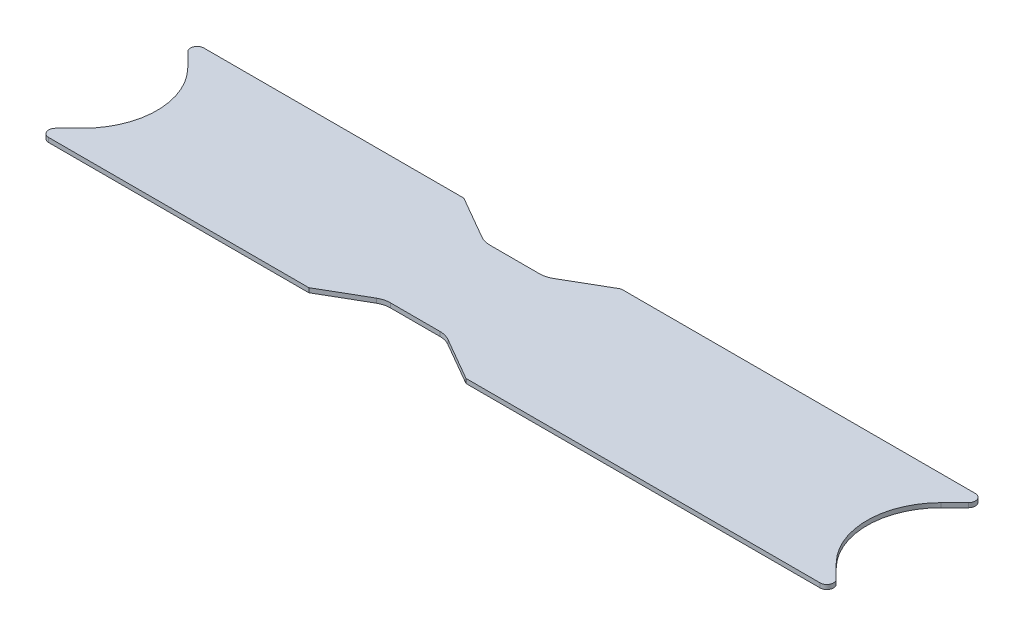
ISO-10303-21;
HEADER;
FILE_DESCRIPTION(('STEP AP214'),'2;1');
FILE_NAME('part.step','',(''),(''),'','','');
FILE_SCHEMA(('AUTOMOTIVE_DESIGN { 1 0 10303 214 1 1 1 1 }'));
ENDSEC;
DATA;
#1=APPLICATION_CONTEXT('core data for automotive mechanical design processes');
#2=APPLICATION_PROTOCOL_DEFINITION('international standard','automotive_design',2000,#1);
#3=PRODUCT_CONTEXT('',#1,'mechanical');
#4=PRODUCT('Part','Part','',(#3));
#5=PRODUCT_RELATED_PRODUCT_CATEGORY('part','',(#4));
#6=PRODUCT_DEFINITION_FORMATION('','',#4);
#7=PRODUCT_DEFINITION_CONTEXT('part definition',#1,'design');
#8=PRODUCT_DEFINITION('design','',#6,#7);
#9=PRODUCT_DEFINITION_SHAPE('','',#8);
#10=(LENGTH_UNIT() NAMED_UNIT(*) SI_UNIT(.MILLI.,.METRE.));
#11=(NAMED_UNIT(*) PLANE_ANGLE_UNIT() SI_UNIT($,.RADIAN.));
#12=(NAMED_UNIT(*) SI_UNIT($,.STERADIAN.) SOLID_ANGLE_UNIT());
#13=UNCERTAINTY_MEASURE_WITH_UNIT(LENGTH_MEASURE(1.E-05),#10,'distance_accuracy_value','');
#14=(GEOMETRIC_REPRESENTATION_CONTEXT(3) GLOBAL_UNCERTAINTY_ASSIGNED_CONTEXT((#13)) GLOBAL_UNIT_ASSIGNED_CONTEXT((#10,
#11,#12)) REPRESENTATION_CONTEXT('',''));
#15=CARTESIAN_POINT('',(0.,0.,0.));
#16=DIRECTION('',(0.,0.,1.));
#17=DIRECTION('',(1.,0.,0.));
#18=AXIS2_PLACEMENT_3D('',#15,#16,#17);
#19=CARTESIAN_POINT('',(-19.375,0.2,0.));
#20=DIRECTION('',(0.,1.,0.));
#21=DIRECTION('',(0.,0.,1.));
#22=AXIS2_PLACEMENT_3D('',#19,#20,#21);
#23=PLANE('',#22);
#24=CARTESIAN_POINT('',(-1.00897459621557,0.199999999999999,3.25));
#25=DIRECTION('',(0.,1.,0.));
#26=DIRECTION('',(0.,0.,1.));
#27=AXIS2_PLACEMENT_3D('',#24,#25,#26);
#28=CIRCLE('',#27,1.);
#29=CARTESIAN_POINT('',(-1.00897459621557,0.199999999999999,2.25));
#30=VERTEX_POINT('',#29);
#31=CARTESIAN_POINT('',(-0.508974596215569,0.199999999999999,2.38397459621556));
#32=VERTEX_POINT('',#31);
#33=EDGE_CURVE('E217',#30,#32,#28,.F.);
#34=ORIENTED_EDGE('',*,*,#33,.T.);
#35=DIRECTION('',(0.866025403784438,0.,0.500000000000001));
#36=VECTOR('',#35,1.);
#37=CARTESIAN_POINT('',(-0.508974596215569,0.199999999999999,2.38397459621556));
#38=LINE('',#37,#36);
#39=CARTESIAN_POINT('',(1.42403810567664,0.199999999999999,3.5));
#40=VERTEX_POINT('',#39);
#41=EDGE_CURVE('E220',#40,#32,#38,.F.);
#42=ORIENTED_EDGE('',*,*,#41,.F.);
#43=DIRECTION('',(1.,0.,0.));
#44=VECTOR('',#43,1.);
#45=CARTESIAN_POINT('',(1.42403810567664,0.199999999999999,3.5));
#46=LINE('',#45,#44);
#47=CARTESIAN_POINT('',(17.4131204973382,0.199999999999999,3.5));
#48=VERTEX_POINT('',#47);
#49=EDGE_CURVE('E113',#48,#40,#46,.F.);
#50=ORIENTED_EDGE('',*,*,#49,.F.);
#51=CARTESIAN_POINT('',(17.4131204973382,0.199999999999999,3.2));
#52=DIRECTION('',(0.,1.,0.));
#53=DIRECTION('',(0.,0.,1.));
#54=AXIS2_PLACEMENT_3D('',#51,#52,#53);
#55=CIRCLE('',#54,0.3);
#56=CARTESIAN_POINT('',(17.6252525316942,0.199999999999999,2.98786796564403));
#57=VERTEX_POINT('',#56);
#58=EDGE_CURVE('E20',#48,#57,#55,.T.);
#59=ORIENTED_EDGE('',*,*,#58,.T.);
#60=DIRECTION('',(-0.707106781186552,0.,-0.707106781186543));
#61=VECTOR('',#60,1.);
#62=CARTESIAN_POINT('',(17.6252525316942,0.199999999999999,2.98786796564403));
#63=LINE('',#62,#61);
#64=CARTESIAN_POINT('',(17.0061922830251,0.199999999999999,2.36880771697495));
#65=VERTEX_POINT('',#64);
#66=EDGE_CURVE('E253',#65,#57,#63,.F.);
#67=ORIENTED_EDGE('',*,*,#66,.F.);
#68=CARTESIAN_POINT('',(19.375,0.199999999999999,0.));
#69=DIRECTION('',(0.,1.,0.));
#70=DIRECTION('',(0.,0.,1.));
#71=AXIS2_PLACEMENT_3D('',#68,#69,#70);
#72=CIRCLE('',#71,3.35);
#73=CARTESIAN_POINT('',(17.0061922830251,0.199999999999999,-2.36880771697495));
#74=VERTEX_POINT('',#73);
#75=EDGE_CURVE('E251',#65,#74,#72,.F.);
#76=ORIENTED_EDGE('',*,*,#75,.T.);
#77=DIRECTION('',(0.707106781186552,0.,-0.707106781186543));
#78=VECTOR('',#77,1.);
#79=CARTESIAN_POINT('',(17.0061922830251,0.199999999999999,-2.36880771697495));
#80=LINE('',#79,#78);
#81=CARTESIAN_POINT('',(17.6252525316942,0.199999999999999,-2.98786796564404));
#82=VERTEX_POINT('',#81);
#83=EDGE_CURVE('E194',#82,#74,#80,.F.);
#84=ORIENTED_EDGE('',*,*,#83,.F.);
#85=CARTESIAN_POINT('',(17.4131204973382,0.199999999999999,-3.2));
#86=DIRECTION('',(0.,1.,0.));
#87=DIRECTION('',(0.,0.,1.));
#88=AXIS2_PLACEMENT_3D('',#85,#86,#87);
#89=CIRCLE('',#88,0.299999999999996);
#90=CARTESIAN_POINT('',(17.4131204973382,0.199999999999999,-3.5));
#91=VERTEX_POINT('',#90);
#92=EDGE_CURVE('E196',#91,#82,#89,.F.);
#93=ORIENTED_EDGE('',*,*,#92,.F.);
#94=DIRECTION('',(-1.,0.,0.));
#95=VECTOR('',#94,1.);
#96=CARTESIAN_POINT('',(17.4131204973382,0.199999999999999,-3.5));
#97=LINE('',#96,#95);
#98=CARTESIAN_POINT('',(1.42403810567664,0.200000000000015,-3.5));
#99=VERTEX_POINT('',#98);
#100=EDGE_CURVE('E299',#99,#91,#97,.F.);
#101=ORIENTED_EDGE('',*,*,#100,.F.);
#102=DIRECTION('',(-0.866025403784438,0.,0.500000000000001));
#103=VECTOR('',#102,1.);
#104=CARTESIAN_POINT('',(1.42403810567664,0.200000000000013,-3.5));
#105=LINE('',#104,#103);
#106=CARTESIAN_POINT('',(-0.508974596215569,0.200000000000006,-2.38397459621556));
#107=VERTEX_POINT('',#106);
#108=EDGE_CURVE('E293',#107,#99,#105,.F.);
#109=ORIENTED_EDGE('',*,*,#108,.F.);
#110=CARTESIAN_POINT('',(-1.00897459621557,0.199999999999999,-3.25));
#111=DIRECTION('',(0.,1.,0.));
#112=DIRECTION('',(0.,0.,1.));
#113=AXIS2_PLACEMENT_3D('',#110,#111,#112);
#114=CIRCLE('',#113,1.);
#115=CARTESIAN_POINT('',(-1.00897459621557,0.199999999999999,-2.25));
#116=VERTEX_POINT('',#115);
#117=EDGE_CURVE('E245',#107,#116,#114,.F.);
#118=ORIENTED_EDGE('',*,*,#117,.T.);
#119=DIRECTION('',(-1.,0.,0.));
#120=VECTOR('',#119,1.);
#121=CARTESIAN_POINT('',(-1.00897459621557,0.199999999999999,-2.25));
#122=LINE('',#121,#120);
#123=CARTESIAN_POINT('',(-3.24102540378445,0.199999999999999,-2.25));
#124=VERTEX_POINT('',#123);
#125=EDGE_CURVE('E248',#124,#116,#122,.F.);
#126=ORIENTED_EDGE('',*,*,#125,.F.);
#127=CARTESIAN_POINT('',(-3.24102540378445,0.199999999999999,-3.25));
#128=DIRECTION('',(0.,1.,0.));
#129=DIRECTION('',(0.,0.,1.));
#130=AXIS2_PLACEMENT_3D('',#127,#128,#129);
#131=CIRCLE('',#130,1.);
#132=CARTESIAN_POINT('',(-3.74102540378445,0.199999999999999,-2.38397459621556));
#133=VERTEX_POINT('',#132);
#134=EDGE_CURVE('E240',#124,#133,#131,.F.);
#135=ORIENTED_EDGE('',*,*,#134,.T.);
#136=DIRECTION('',(-0.866025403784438,0.,-0.500000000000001));
#137=VECTOR('',#136,1.);
#138=CARTESIAN_POINT('',(-3.74102540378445,0.199999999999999,-2.38397459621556));
#139=LINE('',#138,#137);
#140=CARTESIAN_POINT('',(-5.67403810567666,0.199999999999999,-3.5));
#141=VERTEX_POINT('',#140);
#142=EDGE_CURVE('E243',#141,#133,#139,.F.);
#143=ORIENTED_EDGE('',*,*,#142,.F.);
#144=DIRECTION('',(-1.,0.,0.));
#145=VECTOR('',#144,1.);
#146=CARTESIAN_POINT('',(-5.67403810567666,0.199999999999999,-3.5));
#147=LINE('',#146,#145);
#148=CARTESIAN_POINT('',(-17.4131204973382,0.199999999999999,-3.5));
#149=VERTEX_POINT('',#148);
#150=EDGE_CURVE('E283',#149,#141,#147,.F.);
#151=ORIENTED_EDGE('',*,*,#150,.F.);
#152=CARTESIAN_POINT('',(-17.4131204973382,0.199999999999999,-3.2));
#153=DIRECTION('',(0.,1.,0.));
#154=DIRECTION('',(0.,0.,1.));
#155=AXIS2_PLACEMENT_3D('',#152,#153,#154);
#156=CIRCLE('',#155,0.3);
#157=CARTESIAN_POINT('',(-17.6252525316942,0.199999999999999,-2.98786796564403));
#158=VERTEX_POINT('',#157);
#159=EDGE_CURVE('E236',#158,#149,#156,.F.);
#160=ORIENTED_EDGE('',*,*,#159,.F.);
#161=DIRECTION('',(0.707106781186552,0.,0.707106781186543));
#162=VECTOR('',#161,1.);
#163=CARTESIAN_POINT('',(-17.6252525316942,0.199999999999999,-2.98786796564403));
#164=LINE('',#163,#162);
#165=CARTESIAN_POINT('',(-17.0061922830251,0.199999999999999,-2.36880771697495));
#166=VERTEX_POINT('',#165);
#167=EDGE_CURVE('E280',#166,#158,#164,.F.);
#168=ORIENTED_EDGE('',*,*,#167,.F.);
#169=CARTESIAN_POINT('',(-19.375,0.199999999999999,0.));
#170=DIRECTION('',(0.,1.,0.));
#171=DIRECTION('',(0.,0.,1.));
#172=AXIS2_PLACEMENT_3D('',#169,#170,#171);
#173=CIRCLE('',#172,3.35);
#174=CARTESIAN_POINT('',(-17.0061922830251,0.199999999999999,2.36880771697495));
#175=VERTEX_POINT('',#174);
#176=EDGE_CURVE('E231',#166,#175,#173,.F.);
#177=ORIENTED_EDGE('',*,*,#176,.T.);
#178=DIRECTION('',(-0.707106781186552,0.,0.707106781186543));
#179=VECTOR('',#178,1.);
#180=CARTESIAN_POINT('',(-17.0061922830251,0.199999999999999,2.36880771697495));
#181=LINE('',#180,#179);
#182=CARTESIAN_POINT('',(-17.6252525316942,0.199999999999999,2.98786796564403));
#183=VERTEX_POINT('',#182);
#184=EDGE_CURVE('E234',#183,#175,#181,.F.);
#185=ORIENTED_EDGE('',*,*,#184,.F.);
#186=CARTESIAN_POINT('',(-17.4131204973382,0.199999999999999,3.2));
#187=DIRECTION('',(0.,1.,0.));
#188=DIRECTION('',(0.,0.,1.));
#189=AXIS2_PLACEMENT_3D('',#186,#187,#188);
#190=CIRCLE('',#189,0.3);
#191=CARTESIAN_POINT('',(-17.4131204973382,0.199999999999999,3.5));
#192=VERTEX_POINT('',#191);
#193=EDGE_CURVE('E227',#192,#183,#190,.F.);
#194=ORIENTED_EDGE('',*,*,#193,.F.);
#195=DIRECTION('',(1.,0.,0.));
#196=VECTOR('',#195,1.);
#197=CARTESIAN_POINT('',(-17.4131204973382,0.199999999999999,3.5));
#198=LINE('',#197,#196);
#199=CARTESIAN_POINT('',(-5.67403810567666,0.199999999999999,3.5));
#200=VERTEX_POINT('',#199);
#201=EDGE_CURVE('E275',#200,#192,#198,.F.);
#202=ORIENTED_EDGE('',*,*,#201,.F.);
#203=DIRECTION('',(0.866025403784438,0.,-0.500000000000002));
#204=VECTOR('',#203,1.);
#205=CARTESIAN_POINT('',(-5.67403810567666,0.199999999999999,3.5));
#206=LINE('',#205,#204);
#207=CARTESIAN_POINT('',(-3.74102540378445,0.199999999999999,2.38397459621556));
#208=VERTEX_POINT('',#207);
#209=EDGE_CURVE('E269',#208,#200,#206,.F.);
#210=ORIENTED_EDGE('',*,*,#209,.F.);
#211=CARTESIAN_POINT('',(-3.24102540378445,0.199999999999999,3.25));
#212=DIRECTION('',(0.,1.,0.));
#213=DIRECTION('',(0.,0.,1.));
#214=AXIS2_PLACEMENT_3D('',#211,#212,#213);
#215=CIRCLE('',#214,1.);
#216=CARTESIAN_POINT('',(-3.24102540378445,0.199999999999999,2.25));
#217=VERTEX_POINT('',#216);
#218=EDGE_CURVE('E222',#208,#217,#215,.F.);
#219=ORIENTED_EDGE('',*,*,#218,.T.);
#220=DIRECTION('',(1.,0.,0.));
#221=VECTOR('',#220,1.);
#222=CARTESIAN_POINT('',(-3.24102540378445,0.199999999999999,2.25));
#223=LINE('',#222,#221);
#224=EDGE_CURVE('E225',#30,#217,#223,.F.);
#225=ORIENTED_EDGE('',*,*,#224,.F.);
#226=EDGE_LOOP('',(#34,#42,#50,#59,#67,#76,#84,#93,#101,#109,#118,#126,#135,#143,#151,#160,#168,
#177,#185,#194,#202,#210,#219,#225));
#227=FACE_BOUND('',#226,.T.);
#228=ADVANCED_FACE('F17',(#227),#23,.T.);
#229=CARTESIAN_POINT('',(17.6252525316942,-37.2943833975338,2.98786796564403));
#230=DIRECTION('',(0.707106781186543,0.,-0.707106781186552));
#231=DIRECTION('',(-0.707106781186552,0.,-0.707106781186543));
#232=AXIS2_PLACEMENT_3D('',#229,#230,#231);
#233=PLANE('',#232);
#234=DIRECTION('',(0.,1.,0.));
#235=VECTOR('',#234,1.);
#236=CARTESIAN_POINT('',(17.6252525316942,-37.2943833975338,2.98786796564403));
#237=LINE('',#236,#235);
#238=CARTESIAN_POINT('',(17.6252525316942,0.,2.98786796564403));
#239=VERTEX_POINT('',#238);
#240=EDGE_CURVE('E216',#239,#57,#237,.T.);
#241=ORIENTED_EDGE('',*,*,#240,.F.);
#242=DIRECTION('',(-0.707106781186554,0.,-0.707106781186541));
#243=VECTOR('',#242,1.);
#244=CARTESIAN_POINT('',(17.6252525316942,0.,2.98786796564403));
#245=LINE('',#244,#243);
#246=CARTESIAN_POINT('',(17.0061922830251,0.,2.36880771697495));
#247=VERTEX_POINT('',#246);
#248=EDGE_CURVE('E209',#239,#247,#245,.T.);
#249=ORIENTED_EDGE('',*,*,#248,.T.);
#250=DIRECTION('',(0.,1.,0.));
#251=VECTOR('',#250,1.);
#252=CARTESIAN_POINT('',(17.0061922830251,-37.2943833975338,2.36880771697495));
#253=LINE('',#252,#251);
#254=EDGE_CURVE('E182',#247,#65,#253,.T.);
#255=ORIENTED_EDGE('',*,*,#254,.T.);
#256=ORIENTED_EDGE('',*,*,#66,.T.);
#257=EDGE_LOOP('',(#241,#249,#255,#256));
#258=FACE_BOUND('',#257,.T.);
#259=ADVANCED_FACE('F390',(#258),#233,.T.);
#260=CARTESIAN_POINT('',(19.375,-37.2943833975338,0.));
#261=DIRECTION('',(0.,1.,0.));
#262=DIRECTION('',(0.,0.,1.));
#263=AXIS2_PLACEMENT_3D('',#260,#261,#262);
#264=CYLINDRICAL_SURFACE('',#263,3.35);
#265=ORIENTED_EDGE('',*,*,#75,.F.);
#266=ORIENTED_EDGE('',*,*,#254,.F.);
#267=CARTESIAN_POINT('',(19.375,0.,0.));
#268=DIRECTION('',(0.,1.,0.));
#269=DIRECTION('',(0.,0.,1.));
#270=AXIS2_PLACEMENT_3D('',#267,#268,#269);
#271=CIRCLE('',#270,3.35);
#272=CARTESIAN_POINT('',(17.0061922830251,0.,-2.36880771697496));
#273=VERTEX_POINT('',#272);
#274=EDGE_CURVE('E202',#247,#273,#271,.F.);
#275=ORIENTED_EDGE('',*,*,#274,.T.);
#276=DIRECTION('',(0.,1.,0.));
#277=VECTOR('',#276,1.);
#278=CARTESIAN_POINT('',(17.0061922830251,-37.2943833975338,-2.36880771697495));
#279=LINE('',#278,#277);
#280=EDGE_CURVE('E188',#74,#273,#279,.F.);
#281=ORIENTED_EDGE('',*,*,#280,.F.);
#282=EDGE_LOOP('',(#265,#266,#275,#281));
#283=FACE_BOUND('',#282,.T.);
#284=ADVANCED_FACE('F208',(#283),#264,.F.);
#285=CARTESIAN_POINT('',(17.0061922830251,-37.2943833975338,-2.36880771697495));
#286=DIRECTION('',(0.707106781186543,0.,0.707106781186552));
#287=DIRECTION('',(0.707106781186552,0.,-0.707106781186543));
#288=AXIS2_PLACEMENT_3D('',#285,#286,#287);
#289=PLANE('',#288);
#290=ORIENTED_EDGE('',*,*,#280,.T.);
#291=DIRECTION('',(0.707106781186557,0.,-0.707106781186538));
#292=VECTOR('',#291,1.);
#293=CARTESIAN_POINT('',(17.0061922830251,0.,-2.36880771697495));
#294=LINE('',#293,#292);
#295=CARTESIAN_POINT('',(17.6252525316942,0.,-2.98786796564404));
#296=VERTEX_POINT('',#295);
#297=EDGE_CURVE('E192',#273,#296,#294,.T.);
#298=ORIENTED_EDGE('',*,*,#297,.T.);
#299=DIRECTION('',(0.,1.,0.));
#300=VECTOR('',#299,1.);
#301=CARTESIAN_POINT('',(17.6252525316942,-37.2943833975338,-2.98786796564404));
#302=LINE('',#301,#300);
#303=EDGE_CURVE('E250',#82,#296,#302,.F.);
#304=ORIENTED_EDGE('',*,*,#303,.F.);
#305=ORIENTED_EDGE('',*,*,#83,.T.);
#306=EDGE_LOOP('',(#290,#298,#304,#305));
#307=FACE_BOUND('',#306,.T.);
#308=ADVANCED_FACE('F190',(#307),#289,.T.);
#309=CARTESIAN_POINT('',(17.4131204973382,-37.2943833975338,-3.2));
#310=DIRECTION('',(0.,1.,0.));
#311=DIRECTION('',(0.,0.,1.));
#312=AXIS2_PLACEMENT_3D('',#309,#310,#311);
#313=CYLINDRICAL_SURFACE('',#312,0.299999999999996);
#314=ORIENTED_EDGE('',*,*,#303,.T.);
#315=CARTESIAN_POINT('',(17.4131204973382,0.,-3.2));
#316=DIRECTION('',(0.,1.,0.));
#317=DIRECTION('',(0.,0.,1.));
#318=AXIS2_PLACEMENT_3D('',#315,#316,#317);
#319=CIRCLE('',#318,0.299999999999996);
#320=CARTESIAN_POINT('',(17.4131204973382,0.,-3.5));
#321=VERTEX_POINT('',#320);
#322=EDGE_CURVE('E206',#296,#321,#319,.T.);
#323=ORIENTED_EDGE('',*,*,#322,.T.);
#324=DIRECTION('',(0.,1.,0.));
#325=VECTOR('',#324,1.);
#326=CARTESIAN_POINT('',(17.4131204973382,-37.2943833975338,-3.5));
#327=LINE('',#326,#325);
#328=EDGE_CURVE('E296',#91,#321,#327,.F.);
#329=ORIENTED_EDGE('',*,*,#328,.F.);
#330=ORIENTED_EDGE('',*,*,#92,.T.);
#331=EDGE_LOOP('',(#314,#323,#329,#330));
#332=FACE_BOUND('',#331,.T.);
#333=ADVANCED_FACE('F383',(#332),#313,.T.);
#334=CARTESIAN_POINT('',(17.4131204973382,-37.2943833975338,-3.5));
#335=DIRECTION('',(0.,0.,-1.));
#336=DIRECTION('',(-1.,0.,0.));
#337=AXIS2_PLACEMENT_3D('',#334,#335,#336);
#338=PLANE('',#337);
#339=ORIENTED_EDGE('',*,*,#328,.T.);
#340=DIRECTION('',(1.,0.,0.));
#341=VECTOR('',#340,1.);
#342=CARTESIAN_POINT('',(-19.375,0.,-3.5));
#343=LINE('',#342,#341);
#344=CARTESIAN_POINT('',(1.42403810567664,0.,-3.5));
#345=VERTEX_POINT('',#344);
#346=EDGE_CURVE('E338',#321,#345,#343,.F.);
#347=ORIENTED_EDGE('',*,*,#346,.T.);
#348=DIRECTION('',(0.,1.,0.));
#349=VECTOR('',#348,1.);
#350=CARTESIAN_POINT('',(1.42403810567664,-37.2943833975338,-3.5));
#351=LINE('',#350,#349);
#352=EDGE_CURVE('E295',#99,#345,#351,.F.);
#353=ORIENTED_EDGE('',*,*,#352,.F.);
#354=ORIENTED_EDGE('',*,*,#100,.T.);
#355=EDGE_LOOP('',(#339,#347,#353,#354));
#356=FACE_BOUND('',#355,.T.);
#357=ADVANCED_FACE('F472',(#356),#338,.T.);
#358=CARTESIAN_POINT('',(1.42403810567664,-37.2943833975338,-3.5));
#359=DIRECTION('',(-0.500000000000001,0.,-0.866025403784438));
#360=DIRECTION('',(-0.866025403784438,0.,0.500000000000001));
#361=AXIS2_PLACEMENT_3D('',#358,#359,#360);
#362=PLANE('',#361);
#363=ORIENTED_EDGE('',*,*,#352,.T.);
#364=DIRECTION('',(-0.866025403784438,0.,0.500000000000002));
#365=VECTOR('',#364,1.);
#366=CARTESIAN_POINT('',(1.42403810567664,0.,-3.5));
#367=LINE('',#366,#365);
#368=CARTESIAN_POINT('',(-0.508974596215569,0.,-2.38397459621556));
#369=VERTEX_POINT('',#368);
#370=EDGE_CURVE('E331',#345,#369,#367,.T.);
#371=ORIENTED_EDGE('',*,*,#370,.T.);
#372=DIRECTION('',(0.,1.,0.));
#373=VECTOR('',#372,1.);
#374=CARTESIAN_POINT('',(-0.508974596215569,-37.2943833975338,-2.38397459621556));
#375=LINE('',#374,#373);
#376=EDGE_CURVE('E249',#369,#107,#375,.T.);
#377=ORIENTED_EDGE('',*,*,#376,.T.);
#378=ORIENTED_EDGE('',*,*,#108,.T.);
#379=EDGE_LOOP('',(#363,#371,#377,#378));
#380=FACE_BOUND('',#379,.T.);
#381=ADVANCED_FACE('F469',(#380),#362,.T.);
#382=CARTESIAN_POINT('',(-1.00897459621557,-37.2943833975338,-3.25));
#383=DIRECTION('',(0.,1.,0.));
#384=DIRECTION('',(0.,0.,1.));
#385=AXIS2_PLACEMENT_3D('',#382,#383,#384);
#386=CYLINDRICAL_SURFACE('',#385,1.);
#387=ORIENTED_EDGE('',*,*,#117,.F.);
#388=ORIENTED_EDGE('',*,*,#376,.F.);
#389=CARTESIAN_POINT('',(-1.00897459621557,0.,-3.25));
#390=DIRECTION('',(0.,1.,0.));
#391=DIRECTION('',(0.,0.,1.));
#392=AXIS2_PLACEMENT_3D('',#389,#390,#391);
#393=CIRCLE('',#392,1.);
#394=CARTESIAN_POINT('',(-1.00897459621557,0.,-2.25));
#395=VERTEX_POINT('',#394);
#396=EDGE_CURVE('E329',#369,#395,#393,.F.);
#397=ORIENTED_EDGE('',*,*,#396,.T.);
#398=DIRECTION('',(0.,1.,0.));
#399=VECTOR('',#398,1.);
#400=CARTESIAN_POINT('',(-1.00897459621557,-37.2943833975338,-2.25));
#401=LINE('',#400,#399);
#402=EDGE_CURVE('E292',#116,#395,#401,.F.);
#403=ORIENTED_EDGE('',*,*,#402,.F.);
#404=EDGE_LOOP('',(#387,#388,#397,#403));
#405=FACE_BOUND('',#404,.T.);
#406=ADVANCED_FACE('F465',(#405),#386,.F.);
#407=CARTESIAN_POINT('',(-1.00897459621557,-37.2943833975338,-2.25));
#408=DIRECTION('',(0.,0.,-1.));
#409=DIRECTION('',(-1.,0.,0.));
#410=AXIS2_PLACEMENT_3D('',#407,#408,#409);
#411=PLANE('',#410);
#412=ORIENTED_EDGE('',*,*,#402,.T.);
#413=DIRECTION('',(1.,0.,0.));
#414=VECTOR('',#413,1.);
#415=CARTESIAN_POINT('',(-19.375,0.,-2.25));
#416=LINE('',#415,#414);
#417=CARTESIAN_POINT('',(-3.24102540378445,0.,-2.25));
#418=VERTEX_POINT('',#417);
#419=EDGE_CURVE('E328',#395,#418,#416,.F.);
#420=ORIENTED_EDGE('',*,*,#419,.T.);
#421=DIRECTION('',(0.,1.,0.));
#422=VECTOR('',#421,1.);
#423=CARTESIAN_POINT('',(-3.24102540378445,-37.2943833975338,-2.25));
#424=LINE('',#423,#422);
#425=EDGE_CURVE('E244',#418,#124,#424,.T.);
#426=ORIENTED_EDGE('',*,*,#425,.T.);
#427=ORIENTED_EDGE('',*,*,#125,.T.);
#428=EDGE_LOOP('',(#412,#420,#426,#427));
#429=FACE_BOUND('',#428,.T.);
#430=ADVANCED_FACE('F461',(#429),#411,.T.);
#431=CARTESIAN_POINT('',(-3.24102540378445,-37.2943833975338,-3.25));
#432=DIRECTION('',(0.,1.,0.));
#433=DIRECTION('',(0.,0.,1.));
#434=AXIS2_PLACEMENT_3D('',#431,#432,#433);
#435=CYLINDRICAL_SURFACE('',#434,1.);
#436=ORIENTED_EDGE('',*,*,#134,.F.);
#437=ORIENTED_EDGE('',*,*,#425,.F.);
#438=CARTESIAN_POINT('',(-3.24102540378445,0.,-3.25));
#439=DIRECTION('',(0.,1.,0.));
#440=DIRECTION('',(0.,0.,1.));
#441=AXIS2_PLACEMENT_3D('',#438,#439,#440);
#442=CIRCLE('',#441,1.);
#443=CARTESIAN_POINT('',(-3.74102540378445,0.,-2.38397459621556));
#444=VERTEX_POINT('',#443);
#445=EDGE_CURVE('E325',#418,#444,#442,.F.);
#446=ORIENTED_EDGE('',*,*,#445,.T.);
#447=DIRECTION('',(0.,1.,0.));
#448=VECTOR('',#447,1.);
#449=CARTESIAN_POINT('',(-3.74102540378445,-37.2943833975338,-2.38397459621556));
#450=LINE('',#449,#448);
#451=EDGE_CURVE('E285',#133,#444,#450,.F.);
#452=ORIENTED_EDGE('',*,*,#451,.F.);
#453=EDGE_LOOP('',(#436,#437,#446,#452));
#454=FACE_BOUND('',#453,.T.);
#455=ADVANCED_FACE('F457',(#454),#435,.F.);
#456=CARTESIAN_POINT('',(-3.74102540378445,-37.2943833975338,-2.38397459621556));
#457=DIRECTION('',(0.500000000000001,0.,-0.866025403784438));
#458=DIRECTION('',(-0.866025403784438,0.,-0.500000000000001));
#459=AXIS2_PLACEMENT_3D('',#456,#457,#458);
#460=PLANE('',#459);
#461=ORIENTED_EDGE('',*,*,#451,.T.);
#462=DIRECTION('',(-0.866025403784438,0.,-0.500000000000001));
#463=VECTOR('',#462,1.);
#464=CARTESIAN_POINT('',(-3.74102540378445,0.,-2.38397459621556));
#465=LINE('',#464,#463);
#466=CARTESIAN_POINT('',(-5.67403810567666,0.,-3.5));
#467=VERTEX_POINT('',#466);
#468=EDGE_CURVE('E327',#444,#467,#465,.T.);
#469=ORIENTED_EDGE('',*,*,#468,.T.);
#470=DIRECTION('',(0.,1.,0.));
#471=VECTOR('',#470,1.);
#472=CARTESIAN_POINT('',(-5.67403810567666,-37.2943833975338,-3.5));
#473=LINE('',#472,#471);
#474=EDGE_CURVE('E239',#141,#467,#473,.F.);
#475=ORIENTED_EDGE('',*,*,#474,.F.);
#476=ORIENTED_EDGE('',*,*,#142,.T.);
#477=EDGE_LOOP('',(#461,#469,#475,#476));
#478=FACE_BOUND('',#477,.T.);
#479=ADVANCED_FACE('F453',(#478),#460,.T.);
#480=CARTESIAN_POINT('',(-5.67403810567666,-37.2943833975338,-3.5));
#481=DIRECTION('',(0.,0.,-1.));
#482=DIRECTION('',(-1.,0.,0.));
#483=AXIS2_PLACEMENT_3D('',#480,#481,#482);
#484=PLANE('',#483);
#485=ORIENTED_EDGE('',*,*,#474,.T.);
#486=DIRECTION('',(1.,0.,0.));
#487=VECTOR('',#486,1.);
#488=CARTESIAN_POINT('',(-19.375,0.,-3.5));
#489=LINE('',#488,#487);
#490=CARTESIAN_POINT('',(-17.4131204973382,0.,-3.5));
#491=VERTEX_POINT('',#490);
#492=EDGE_CURVE('E324',#467,#491,#489,.F.);
#493=ORIENTED_EDGE('',*,*,#492,.T.);
#494=DIRECTION('',(0.,1.,0.));
#495=VECTOR('',#494,1.);
#496=CARTESIAN_POINT('',(-17.4131204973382,-37.2943833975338,-3.5));
#497=LINE('',#496,#495);
#498=EDGE_CURVE('E238',#149,#491,#497,.F.);
#499=ORIENTED_EDGE('',*,*,#498,.F.);
#500=ORIENTED_EDGE('',*,*,#150,.T.);
#501=EDGE_LOOP('',(#485,#493,#499,#500));
#502=FACE_BOUND('',#501,.T.);
#503=ADVANCED_FACE('F449',(#502),#484,.T.);
#504=CARTESIAN_POINT('',(-17.4131204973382,-37.2943833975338,-3.2));
#505=DIRECTION('',(0.,1.,0.));
#506=DIRECTION('',(0.,0.,1.));
#507=AXIS2_PLACEMENT_3D('',#504,#505,#506);
#508=CYLINDRICAL_SURFACE('',#507,0.3);
#509=ORIENTED_EDGE('',*,*,#498,.T.);
#510=CARTESIAN_POINT('',(-17.4131204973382,0.,-3.2));
#511=DIRECTION('',(0.,1.,0.));
#512=DIRECTION('',(0.,0.,1.));
#513=AXIS2_PLACEMENT_3D('',#510,#511,#512);
#514=CIRCLE('',#513,0.3);
#515=CARTESIAN_POINT('',(-17.6252525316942,0.,-2.98786796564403));
#516=VERTEX_POINT('',#515);
#517=EDGE_CURVE('E321',#491,#516,#514,.T.);
#518=ORIENTED_EDGE('',*,*,#517,.T.);
#519=DIRECTION('',(0.,1.,0.));
#520=VECTOR('',#519,1.);
#521=CARTESIAN_POINT('',(-17.6252525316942,-37.2943833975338,-2.98786796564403));
#522=LINE('',#521,#520);
#523=EDGE_CURVE('E282',#158,#516,#522,.F.);
#524=ORIENTED_EDGE('',*,*,#523,.F.);
#525=ORIENTED_EDGE('',*,*,#159,.T.);
#526=EDGE_LOOP('',(#509,#518,#524,#525));
#527=FACE_BOUND('',#526,.T.);
#528=ADVANCED_FACE('F445',(#527),#508,.T.);
#529=CARTESIAN_POINT('',(-17.6252525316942,-37.2943833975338,-2.98786796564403));
#530=DIRECTION('',(-0.707106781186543,0.,0.707106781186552));
#531=DIRECTION('',(0.707106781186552,0.,0.707106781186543));
#532=AXIS2_PLACEMENT_3D('',#529,#530,#531);
#533=PLANE('',#532);
#534=ORIENTED_EDGE('',*,*,#523,.T.);
#535=DIRECTION('',(0.707106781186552,0.,0.707106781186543));
#536=VECTOR('',#535,1.);
#537=CARTESIAN_POINT('',(-17.6252525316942,0.,-2.98786796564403));
#538=LINE('',#537,#536);
#539=CARTESIAN_POINT('',(-17.0061922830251,0.,-2.36880771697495));
#540=VERTEX_POINT('',#539);
#541=EDGE_CURVE('E320',#516,#540,#538,.T.);
#542=ORIENTED_EDGE('',*,*,#541,.T.);
#543=DIRECTION('',(0.,1.,0.));
#544=VECTOR('',#543,1.);
#545=CARTESIAN_POINT('',(-17.0061922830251,-37.2943833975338,-2.36880771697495));
#546=LINE('',#545,#544);
#547=EDGE_CURVE('E235',#540,#166,#546,.T.);
#548=ORIENTED_EDGE('',*,*,#547,.T.);
#549=ORIENTED_EDGE('',*,*,#167,.T.);
#550=EDGE_LOOP('',(#534,#542,#548,#549));
#551=FACE_BOUND('',#550,.T.);
#552=ADVANCED_FACE('F441',(#551),#533,.T.);
#553=CARTESIAN_POINT('',(-19.375,-37.2943833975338,0.));
#554=DIRECTION('',(0.,1.,0.));
#555=DIRECTION('',(0.,0.,1.));
#556=AXIS2_PLACEMENT_3D('',#553,#554,#555);
#557=CYLINDRICAL_SURFACE('',#556,3.35);
#558=ORIENTED_EDGE('',*,*,#176,.F.);
#559=ORIENTED_EDGE('',*,*,#547,.F.);
#560=CARTESIAN_POINT('',(-19.375,0.,0.));
#561=DIRECTION('',(0.,1.,0.));
#562=DIRECTION('',(0.,0.,1.));
#563=AXIS2_PLACEMENT_3D('',#560,#561,#562);
#564=CIRCLE('',#563,3.35);
#565=CARTESIAN_POINT('',(-17.0061922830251,0.,2.36880771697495));
#566=VERTEX_POINT('',#565);
#567=EDGE_CURVE('E317',#540,#566,#564,.F.);
#568=ORIENTED_EDGE('',*,*,#567,.T.);
#569=DIRECTION('',(0.,1.,0.));
#570=VECTOR('',#569,1.);
#571=CARTESIAN_POINT('',(-17.0061922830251,-37.2943833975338,2.36880771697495));
#572=LINE('',#571,#570);
#573=EDGE_CURVE('E230',#175,#566,#572,.F.);
#574=ORIENTED_EDGE('',*,*,#573,.F.);
#575=EDGE_LOOP('',(#558,#559,#568,#574));
#576=FACE_BOUND('',#575,.T.);
#577=ADVANCED_FACE('F437',(#576),#557,.F.);
#578=CARTESIAN_POINT('',(-17.0061922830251,-37.2943833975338,2.36880771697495));
#579=DIRECTION('',(-0.707106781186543,0.,-0.707106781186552));
#580=DIRECTION('',(-0.707106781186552,0.,0.707106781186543));
#581=AXIS2_PLACEMENT_3D('',#578,#579,#580);
#582=PLANE('',#581);
#583=ORIENTED_EDGE('',*,*,#573,.T.);
#584=DIRECTION('',(-0.707106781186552,0.,0.707106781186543));
#585=VECTOR('',#584,1.);
#586=CARTESIAN_POINT('',(-17.0061922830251,0.,2.36880771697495));
#587=LINE('',#586,#585);
#588=CARTESIAN_POINT('',(-17.6252525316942,0.,2.98786796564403));
#589=VERTEX_POINT('',#588);
#590=EDGE_CURVE('E316',#566,#589,#587,.T.);
#591=ORIENTED_EDGE('',*,*,#590,.T.);
#592=DIRECTION('',(0.,1.,0.));
#593=VECTOR('',#592,1.);
#594=CARTESIAN_POINT('',(-17.6252525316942,-37.2943833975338,2.98786796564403));
#595=LINE('',#594,#593);
#596=EDGE_CURVE('E229',#183,#589,#595,.F.);
#597=ORIENTED_EDGE('',*,*,#596,.F.);
#598=ORIENTED_EDGE('',*,*,#184,.T.);
#599=EDGE_LOOP('',(#583,#591,#597,#598));
#600=FACE_BOUND('',#599,.T.);
#601=ADVANCED_FACE('F433',(#600),#582,.T.);
#602=CARTESIAN_POINT('',(-17.4131204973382,-37.2943833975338,3.2));
#603=DIRECTION('',(0.,1.,0.));
#604=DIRECTION('',(0.,0.,1.));
#605=AXIS2_PLACEMENT_3D('',#602,#603,#604);
#606=CYLINDRICAL_SURFACE('',#605,0.3);
#607=ORIENTED_EDGE('',*,*,#596,.T.);
#608=CARTESIAN_POINT('',(-17.4131204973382,0.,3.2));
#609=DIRECTION('',(0.,1.,0.));
#610=DIRECTION('',(0.,0.,1.));
#611=AXIS2_PLACEMENT_3D('',#608,#609,#610);
#612=CIRCLE('',#611,0.3);
#613=CARTESIAN_POINT('',(-17.4131204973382,0.,3.5));
#614=VERTEX_POINT('',#613);
#615=EDGE_CURVE('E312',#589,#614,#612,.T.);
#616=ORIENTED_EDGE('',*,*,#615,.T.);
#617=DIRECTION('',(0.,1.,0.));
#618=VECTOR('',#617,1.);
#619=CARTESIAN_POINT('',(-17.4131204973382,-37.2943833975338,3.5));
#620=LINE('',#619,#618);
#621=EDGE_CURVE('E272',#192,#614,#620,.F.);
#622=ORIENTED_EDGE('',*,*,#621,.F.);
#623=ORIENTED_EDGE('',*,*,#193,.T.);
#624=EDGE_LOOP('',(#607,#616,#622,#623));
#625=FACE_BOUND('',#624,.T.);
#626=ADVANCED_FACE('F429',(#625),#606,.T.);
#627=CARTESIAN_POINT('',(-17.4131204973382,-37.2943833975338,3.5));
#628=DIRECTION('',(0.,0.,1.));
#629=DIRECTION('',(1.,0.,0.));
#630=AXIS2_PLACEMENT_3D('',#627,#628,#629);
#631=PLANE('',#630);
#632=ORIENTED_EDGE('',*,*,#621,.T.);
#633=DIRECTION('',(1.,0.,0.));
#634=VECTOR('',#633,1.);
#635=CARTESIAN_POINT('',(-19.375,0.,3.5));
#636=LINE('',#635,#634);
#637=CARTESIAN_POINT('',(-5.67403810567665,0.,3.5));
#638=VERTEX_POINT('',#637);
#639=EDGE_CURVE('E315',#614,#638,#636,.T.);
#640=ORIENTED_EDGE('',*,*,#639,.T.);
#641=DIRECTION('',(0.,1.,0.));
#642=VECTOR('',#641,1.);
#643=CARTESIAN_POINT('',(-5.67403810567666,-37.2943833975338,3.5));
#644=LINE('',#643,#642);
#645=EDGE_CURVE('E271',#200,#638,#644,.F.);
#646=ORIENTED_EDGE('',*,*,#645,.F.);
#647=ORIENTED_EDGE('',*,*,#201,.T.);
#648=EDGE_LOOP('',(#632,#640,#646,#647));
#649=FACE_BOUND('',#648,.T.);
#650=ADVANCED_FACE('F425',(#649),#631,.T.);
#651=CARTESIAN_POINT('',(-5.67403810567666,-37.2943833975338,3.5));
#652=DIRECTION('',(0.500000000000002,0.,0.866025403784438));
#653=DIRECTION('',(0.866025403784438,0.,-0.500000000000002));
#654=AXIS2_PLACEMENT_3D('',#651,#652,#653);
#655=PLANE('',#654);
#656=ORIENTED_EDGE('',*,*,#645,.T.);
#657=DIRECTION('',(0.866025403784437,0.,-0.500000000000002));
#658=VECTOR('',#657,1.);
#659=CARTESIAN_POINT('',(-5.67403810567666,0.,3.5));
#660=LINE('',#659,#658);
#661=CARTESIAN_POINT('',(-3.74102540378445,0.,2.38397459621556));
#662=VERTEX_POINT('',#661);
#663=EDGE_CURVE('E311',#638,#662,#660,.T.);
#664=ORIENTED_EDGE('',*,*,#663,.T.);
#665=DIRECTION('',(0.,1.,0.));
#666=VECTOR('',#665,1.);
#667=CARTESIAN_POINT('',(-3.74102540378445,-37.2943833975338,2.38397459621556));
#668=LINE('',#667,#666);
#669=EDGE_CURVE('E226',#662,#208,#668,.T.);
#670=ORIENTED_EDGE('',*,*,#669,.T.);
#671=ORIENTED_EDGE('',*,*,#209,.T.);
#672=EDGE_LOOP('',(#656,#664,#670,#671));
#673=FACE_BOUND('',#672,.T.);
#674=ADVANCED_FACE('F421',(#673),#655,.T.);
#675=CARTESIAN_POINT('',(-3.24102540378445,-37.2943833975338,3.25));
#676=DIRECTION('',(0.,1.,0.));
#677=DIRECTION('',(0.,0.,1.));
#678=AXIS2_PLACEMENT_3D('',#675,#676,#677);
#679=CYLINDRICAL_SURFACE('',#678,1.);
#680=ORIENTED_EDGE('',*,*,#218,.F.);
#681=ORIENTED_EDGE('',*,*,#669,.F.);
#682=CARTESIAN_POINT('',(-3.24102540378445,0.,3.25));
#683=DIRECTION('',(0.,1.,0.));
#684=DIRECTION('',(0.,0.,1.));
#685=AXIS2_PLACEMENT_3D('',#682,#683,#684);
#686=CIRCLE('',#685,1.);
#687=CARTESIAN_POINT('',(-3.24102540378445,0.,2.25));
#688=VERTEX_POINT('',#687);
#689=EDGE_CURVE('E308',#662,#688,#686,.F.);
#690=ORIENTED_EDGE('',*,*,#689,.T.);
#691=DIRECTION('',(0.,1.,0.));
#692=VECTOR('',#691,1.);
#693=CARTESIAN_POINT('',(-3.24102540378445,-37.2943833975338,2.25));
#694=LINE('',#693,#692);
#695=EDGE_CURVE('E268',#217,#688,#694,.F.);
#696=ORIENTED_EDGE('',*,*,#695,.F.);
#697=EDGE_LOOP('',(#680,#681,#690,#696));
#698=FACE_BOUND('',#697,.T.);
#699=ADVANCED_FACE('F417',(#698),#679,.F.);
#700=CARTESIAN_POINT('',(-3.24102540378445,-37.2943833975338,2.25));
#701=DIRECTION('',(0.,0.,1.));
#702=DIRECTION('',(1.,0.,0.));
#703=AXIS2_PLACEMENT_3D('',#700,#701,#702);
#704=PLANE('',#703);
#705=ORIENTED_EDGE('',*,*,#695,.T.);
#706=DIRECTION('',(1.,0.,0.));
#707=VECTOR('',#706,1.);
#708=CARTESIAN_POINT('',(-19.375,0.,2.25));
#709=LINE('',#708,#707);
#710=CARTESIAN_POINT('',(-1.00897459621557,0.,2.25));
#711=VERTEX_POINT('',#710);
#712=EDGE_CURVE('E307',#688,#711,#709,.T.);
#713=ORIENTED_EDGE('',*,*,#712,.T.);
#714=DIRECTION('',(0.,1.,0.));
#715=VECTOR('',#714,1.);
#716=CARTESIAN_POINT('',(-1.00897459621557,-37.2943833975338,2.25));
#717=LINE('',#716,#715);
#718=EDGE_CURVE('E221',#711,#30,#717,.T.);
#719=ORIENTED_EDGE('',*,*,#718,.T.);
#720=ORIENTED_EDGE('',*,*,#224,.T.);
#721=EDGE_LOOP('',(#705,#713,#719,#720));
#722=FACE_BOUND('',#721,.T.);
#723=ADVANCED_FACE('F413',(#722),#704,.T.);
#724=CARTESIAN_POINT('',(-1.00897459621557,-37.2943833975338,3.25));
#725=DIRECTION('',(0.,1.,0.));
#726=DIRECTION('',(0.,0.,1.));
#727=AXIS2_PLACEMENT_3D('',#724,#725,#726);
#728=CYLINDRICAL_SURFACE('',#727,1.);
#729=ORIENTED_EDGE('',*,*,#33,.F.);
#730=ORIENTED_EDGE('',*,*,#718,.F.);
#731=CARTESIAN_POINT('',(-1.00897459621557,0.,3.25));
#732=DIRECTION('',(0.,1.,0.));
#733=DIRECTION('',(0.,0.,1.));
#734=AXIS2_PLACEMENT_3D('',#731,#732,#733);
#735=CIRCLE('',#734,1.);
#736=CARTESIAN_POINT('',(-0.50897459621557,0.,2.38397459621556));
#737=VERTEX_POINT('',#736);
#738=EDGE_CURVE('E303',#711,#737,#735,.F.);
#739=ORIENTED_EDGE('',*,*,#738,.T.);
#740=DIRECTION('',(0.,1.,0.));
#741=VECTOR('',#740,1.);
#742=CARTESIAN_POINT('',(-0.508974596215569,-37.2943833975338,2.38397459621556));
#743=LINE('',#742,#741);
#744=EDGE_CURVE('E261',#32,#737,#743,.F.);
#745=ORIENTED_EDGE('',*,*,#744,.F.);
#746=EDGE_LOOP('',(#729,#730,#739,#745));
#747=FACE_BOUND('',#746,.T.);
#748=ADVANCED_FACE('F409',(#747),#728,.F.);
#749=CARTESIAN_POINT('',(-0.508974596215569,-37.2943833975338,2.38397459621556));
#750=DIRECTION('',(-0.500000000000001,0.,0.866025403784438));
#751=DIRECTION('',(0.866025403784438,0.,0.500000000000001));
#752=AXIS2_PLACEMENT_3D('',#749,#750,#751);
#753=PLANE('',#752);
#754=ORIENTED_EDGE('',*,*,#744,.T.);
#755=DIRECTION('',(0.866025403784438,0.,0.500000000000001));
#756=VECTOR('',#755,1.);
#757=CARTESIAN_POINT('',(-0.508974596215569,0.,2.38397459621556));
#758=LINE('',#757,#756);
#759=CARTESIAN_POINT('',(1.42403810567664,0.,3.5));
#760=VERTEX_POINT('',#759);
#761=EDGE_CURVE('E306',#737,#760,#758,.T.);
#762=ORIENTED_EDGE('',*,*,#761,.T.);
#763=DIRECTION('',(0.,1.,0.));
#764=VECTOR('',#763,1.);
#765=CARTESIAN_POINT('',(1.42403810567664,-37.2943833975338,3.5));
#766=LINE('',#765,#764);
#767=EDGE_CURVE('E260',#40,#760,#766,.F.);
#768=ORIENTED_EDGE('',*,*,#767,.F.);
#769=ORIENTED_EDGE('',*,*,#41,.T.);
#770=EDGE_LOOP('',(#754,#762,#768,#769));
#771=FACE_BOUND('',#770,.T.);
#772=ADVANCED_FACE('F406',(#771),#753,.T.);
#773=CARTESIAN_POINT('',(1.42403810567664,-37.2943833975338,3.5));
#774=DIRECTION('',(0.,0.,1.));
#775=DIRECTION('',(1.,0.,0.));
#776=AXIS2_PLACEMENT_3D('',#773,#774,#775);
#777=PLANE('',#776);
#778=ORIENTED_EDGE('',*,*,#767,.T.);
#779=DIRECTION('',(1.,0.,0.));
#780=VECTOR('',#779,1.);
#781=CARTESIAN_POINT('',(-19.375,0.,3.5));
#782=LINE('',#781,#780);
#783=CARTESIAN_POINT('',(17.4131204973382,0.,3.5));
#784=VERTEX_POINT('',#783);
#785=EDGE_CURVE('E26',#760,#784,#782,.T.);
#786=ORIENTED_EDGE('',*,*,#785,.T.);
#787=DIRECTION('',(0.,1.,0.));
#788=VECTOR('',#787,1.);
#789=CARTESIAN_POINT('',(17.4131204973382,-37.2943833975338,3.5));
#790=LINE('',#789,#788);
#791=EDGE_CURVE('E34',#48,#784,#790,.F.);
#792=ORIENTED_EDGE('',*,*,#791,.F.);
#793=ORIENTED_EDGE('',*,*,#49,.T.);
#794=EDGE_LOOP('',(#778,#786,#792,#793));
#795=FACE_BOUND('',#794,.T.);
#796=ADVANCED_FACE('F401',(#795),#777,.T.);
#797=CARTESIAN_POINT('',(17.4131204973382,-37.2943833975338,3.2));
#798=DIRECTION('',(0.,1.,0.));
#799=DIRECTION('',(0.,0.,1.));
#800=AXIS2_PLACEMENT_3D('',#797,#798,#799);
#801=CYLINDRICAL_SURFACE('',#800,0.3);
#802=ORIENTED_EDGE('',*,*,#791,.T.);
#803=CARTESIAN_POINT('',(17.4131204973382,0.,3.2));
#804=DIRECTION('',(0.,1.,0.));
#805=DIRECTION('',(0.,0.,1.));
#806=AXIS2_PLACEMENT_3D('',#803,#804,#805);
#807=CIRCLE('',#806,0.3);
#808=EDGE_CURVE('E11',#784,#239,#807,.T.);
#809=ORIENTED_EDGE('',*,*,#808,.T.);
#810=ORIENTED_EDGE('',*,*,#240,.T.);
#811=ORIENTED_EDGE('',*,*,#58,.F.);
#812=EDGE_LOOP('',(#802,#809,#810,#811));
#813=FACE_BOUND('',#812,.T.);
#814=ADVANCED_FACE('F396',(#813),#801,.T.);
#815=CARTESIAN_POINT('',(-19.375,0.,0.));
#816=DIRECTION('',(0.,1.,0.));
#817=DIRECTION('',(0.,0.,1.));
#818=AXIS2_PLACEMENT_3D('',#815,#816,#817);
#819=PLANE('',#818);
#820=ORIENTED_EDGE('',*,*,#785,.F.);
#821=ORIENTED_EDGE('',*,*,#761,.F.);
#822=ORIENTED_EDGE('',*,*,#738,.F.);
#823=ORIENTED_EDGE('',*,*,#712,.F.);
#824=ORIENTED_EDGE('',*,*,#689,.F.);
#825=ORIENTED_EDGE('',*,*,#663,.F.);
#826=ORIENTED_EDGE('',*,*,#639,.F.);
#827=ORIENTED_EDGE('',*,*,#615,.F.);
#828=ORIENTED_EDGE('',*,*,#590,.F.);
#829=ORIENTED_EDGE('',*,*,#567,.F.);
#830=ORIENTED_EDGE('',*,*,#541,.F.);
#831=ORIENTED_EDGE('',*,*,#517,.F.);
#832=ORIENTED_EDGE('',*,*,#492,.F.);
#833=ORIENTED_EDGE('',*,*,#468,.F.);
#834=ORIENTED_EDGE('',*,*,#445,.F.);
#835=ORIENTED_EDGE('',*,*,#419,.F.);
#836=ORIENTED_EDGE('',*,*,#396,.F.);
#837=ORIENTED_EDGE('',*,*,#370,.F.);
#838=ORIENTED_EDGE('',*,*,#346,.F.);
#839=ORIENTED_EDGE('',*,*,#322,.F.);
#840=ORIENTED_EDGE('',*,*,#297,.F.);
#841=ORIENTED_EDGE('',*,*,#274,.F.);
#842=ORIENTED_EDGE('',*,*,#248,.F.);
#843=ORIENTED_EDGE('',*,*,#808,.F.);
#844=EDGE_LOOP('',(#820,#821,#822,#823,#824,#825,#826,#827,#828,#829,#830,#831,#832,#833,#834,
#835,#836,#837,#838,#839,#840,#841,#842,#843));
#845=FACE_BOUND('',#844,.T.);
#846=ADVANCED_FACE('F201',(#845),#819,.F.);
#847=CLOSED_SHELL('',(#228,#259,#284,#308,#333,#357,#381,#406,#430,#455,#479,#503,#528,#552,
#577,#601,#626,#650,#674,#699,#723,#748,#772,#796,#814,#846));
#848=MANIFOLD_SOLID_BREP('B1',#847);
#849=ADVANCED_BREP_SHAPE_REPRESENTATION('',(#18,#848),#14);
#850=SHAPE_DEFINITION_REPRESENTATION(#9,#849);
ENDSEC;
END-ISO-10303-21;
